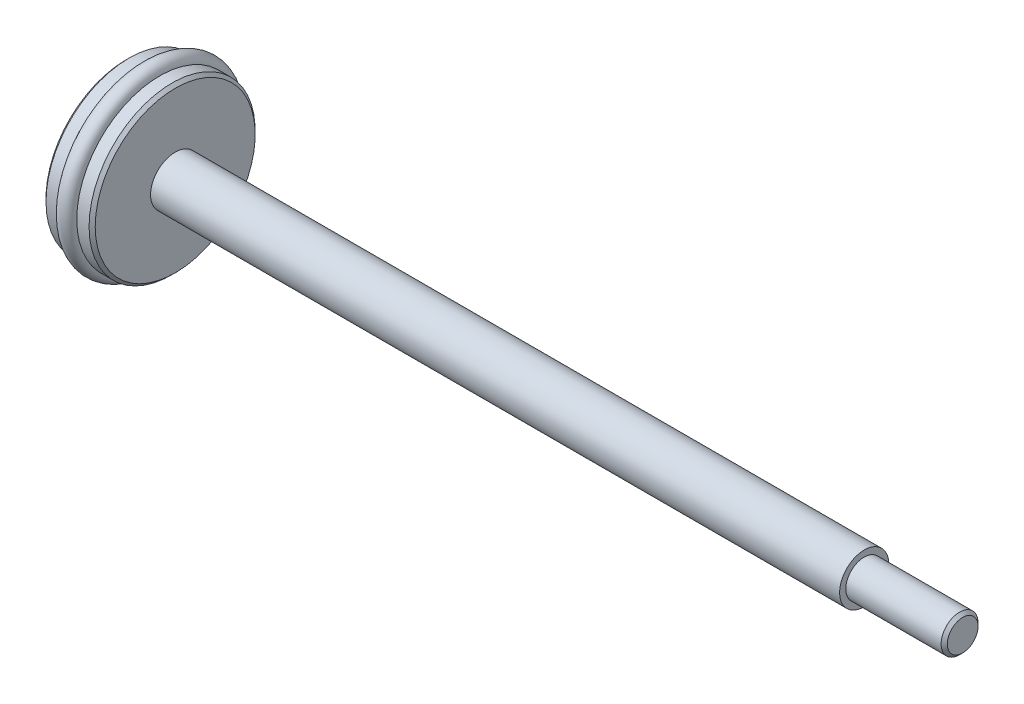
from build123d import *

# Parameters (mm, degrees)
ESQUISSE1_R = 2.773042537


with BuildPart() as part:
    # Esquisse1 → R_volution1 (revolve)
    with BuildSketch(Plane.XY, mode=Mode.PRIVATE) as r_volution1_sk:
        with Locations((7.994041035, 26.725641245)):
            Circle(ESQUISSE1_R)
        Polygon((0, 0), (240, 0), (272, 0), (272, 5), (271, 6), (240, 6), (240, 8), (16, 8), (16, 26), (15, 27), (11, 27), (10.25, 23.9), (5.75, 23.9), (5, 27), (1, 27), (0, 26), align=None)
    revolve(r_volution1_sk.sketch.rotate(Axis((-30.405987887, 0, 0), (1, 0, 0)), 90), axis=Axis((-30.405987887, 0, 0), (1, 0, 0)))


solid = part.part
